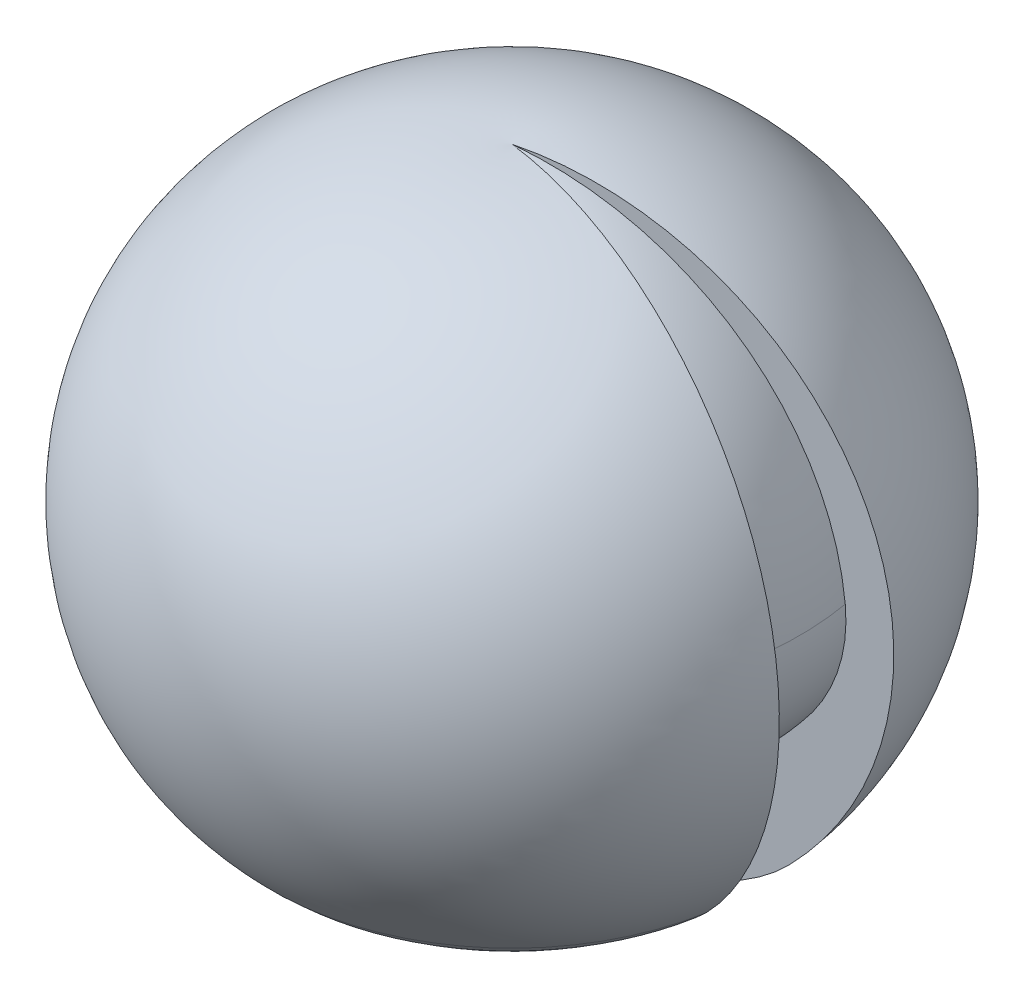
from build123d import *

# Parameters (mm, degrees)
REVOLVE1_ANGLE = 340
REVOLVE2_ANGLE = 340


with BuildPart() as part:
    # Sketch10 → Revolve1 (revolve, symmetric)
    with BuildSketch(Plane.XY) as revolve1_sk:
        with BuildLine():
            Line((0, 620.747964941), (0, 1122.521675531))
            ThreePointArc((0, 1122.521675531), (-741.428524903, 678.473577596), (-586.814255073, -171.814255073))
            ThreePointArc((-586.814255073, -171.814255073), (-396.626535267, -276.404171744), (-180, -262.862988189))
            Line((-180, -262.862988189), (-180, 196.924077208))
            ThreePointArc((-180, 196.924077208), (-247.052830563, 444.496526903), (-26.976313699, 576.23310747))
            ThreePointArc((-26.976313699, 576.23310747), (-14.233214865, 598.942046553), (0, 620.747964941))
        make_face()
    revolve(axis=Axis((0, 620.747964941, 0), (0, 1, 0)), revolution_arc=REVOLVE1_ANGLE / 2)
    revolve(revolve1_sk.sketch, axis=Axis((0, 620.747964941, 0), (0, -1, 0)), revolution_arc=REVOLVE1_ANGLE / 2)

    # Sketch11 → Revolve2 (revolve, symmetric)
    with BuildSketch(Plane.XY) as revolve2_sk:
        with BuildLine():
            Line((0, 620.747964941), (0, 1122.521675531))
            ThreePointArc((0, 1122.521675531), (481.051290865, 907.516004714), (706.28112895, 431.166025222))
            ThreePointArc((706.28112895, 431.166025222), (599.992137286, 128.421894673), (302.41959783, 8.413802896))
            ThreePointArc((302.41959783, 8.413802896), (449.443668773, 408.695659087), (235.145008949, 777.365872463))
            ThreePointArc((235.145008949, 777.365872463), (102.858069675, 721.149066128), (0, 620.747964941))
        make_face()
    revolve(axis=Axis((0, 620.747964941, 0), (0, 1, 0)), revolution_arc=REVOLVE2_ANGLE / 2)
    revolve(revolve2_sk.sketch, axis=Axis((0, 620.747964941, 0), (0, -1, 0)), revolution_arc=REVOLVE2_ANGLE / 2)


solid = part.part
